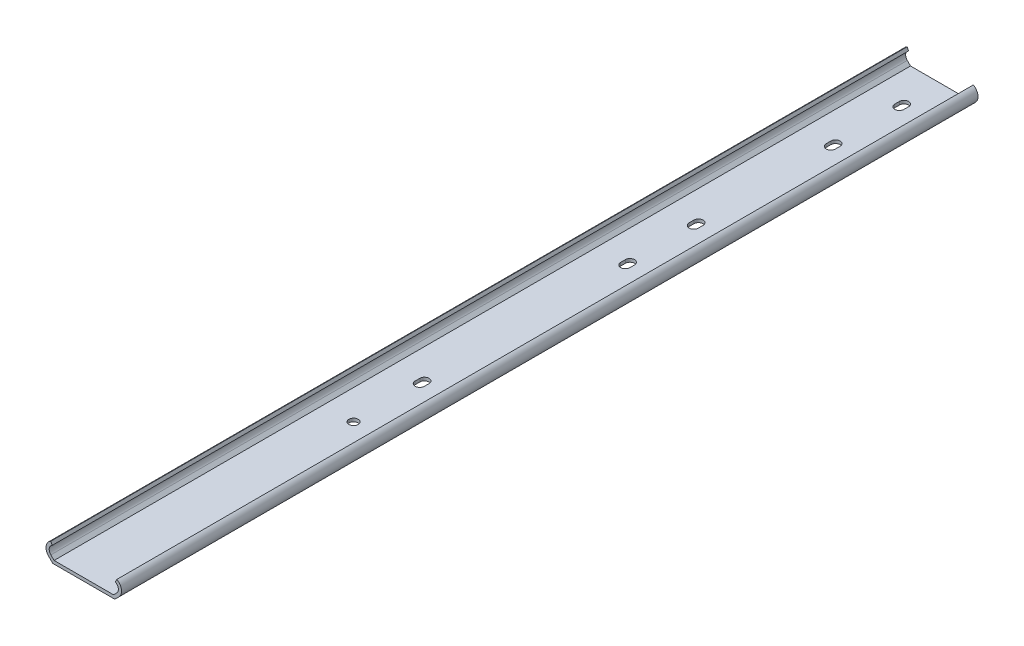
ISO-10303-21;
HEADER;
FILE_DESCRIPTION(('STEP AP214'),'2;1');
FILE_NAME('part.step','',(''),(''),'','','');
FILE_SCHEMA(('AUTOMOTIVE_DESIGN { 1 0 10303 214 1 1 1 1 }'));
ENDSEC;
DATA;
#1=APPLICATION_CONTEXT('core data for automotive mechanical design processes');
#2=APPLICATION_PROTOCOL_DEFINITION('international standard','automotive_design',2000,#1);
#3=PRODUCT_CONTEXT('',#1,'mechanical');
#4=PRODUCT('Part','Part','',(#3));
#5=PRODUCT_RELATED_PRODUCT_CATEGORY('part','',(#4));
#6=PRODUCT_DEFINITION_FORMATION('','',#4);
#7=PRODUCT_DEFINITION_CONTEXT('part definition',#1,'design');
#8=PRODUCT_DEFINITION('design','',#6,#7);
#9=PRODUCT_DEFINITION_SHAPE('','',#8);
#10=(LENGTH_UNIT() NAMED_UNIT(*) SI_UNIT(.MILLI.,.METRE.));
#11=(NAMED_UNIT(*) PLANE_ANGLE_UNIT() SI_UNIT($,.RADIAN.));
#12=(NAMED_UNIT(*) SI_UNIT($,.STERADIAN.) SOLID_ANGLE_UNIT());
#13=UNCERTAINTY_MEASURE_WITH_UNIT(LENGTH_MEASURE(1.E-05),#10,'distance_accuracy_value','');
#14=(GEOMETRIC_REPRESENTATION_CONTEXT(3) GLOBAL_UNCERTAINTY_ASSIGNED_CONTEXT((#13)) GLOBAL_UNIT_ASSIGNED_CONTEXT((#10,
#11,#12)) REPRESENTATION_CONTEXT('',''));
#15=CARTESIAN_POINT('',(0.,0.,0.));
#16=DIRECTION('',(0.,0.,1.));
#17=DIRECTION('',(1.,0.,0.));
#18=AXIS2_PLACEMENT_3D('',#15,#16,#17);
#19=CARTESIAN_POINT('',(14.2265419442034,-0.300999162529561,0.));
#20=DIRECTION('',(0.,0.,1.));
#21=DIRECTION('',(1.,0.,0.));
#22=AXIS2_PLACEMENT_3D('',#19,#20,#21);
#23=CYLINDRICAL_SURFACE('',#22,4.11568542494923);
#24=CARTESIAN_POINT('',(14.2265419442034,-0.300999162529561,0.));
#25=DIRECTION('',(0.,0.,1.));
#26=DIRECTION('',(1.,0.,0.));
#27=AXIS2_PLACEMENT_3D('',#24,#25,#26);
#28=CIRCLE('',#27,4.11568542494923);
#29=CARTESIAN_POINT('',(16.1373492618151,3.34422811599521,0.));
#30=VERTEX_POINT('',#29);
#31=CARTESIAN_POINT('',(17.1367710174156,-3.21122823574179,0.));
#32=VERTEX_POINT('',#31);
#33=EDGE_CURVE('E424',#30,#32,#28,.F.);
#34=ORIENTED_EDGE('',*,*,#33,.F.);
#35=DIRECTION('',(0.,0.,1.));
#36=VECTOR('',#35,1.);
#37=CARTESIAN_POINT('',(16.1373492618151,3.34422811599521,0.));
#38=LINE('',#37,#36);
#39=CARTESIAN_POINT('',(16.1373492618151,3.34422811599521,400.));
#40=VERTEX_POINT('',#39);
#41=EDGE_CURVE('E229',#40,#30,#38,.F.);
#42=ORIENTED_EDGE('',*,*,#41,.F.);
#43=CARTESIAN_POINT('',(14.2265419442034,-0.300999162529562,400.));
#44=DIRECTION('',(0.,0.,1.));
#45=DIRECTION('',(1.,0.,0.));
#46=AXIS2_PLACEMENT_3D('',#43,#44,#45);
#47=CIRCLE('',#46,4.11568542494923);
#48=CARTESIAN_POINT('',(17.1367710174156,-3.2112282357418,400.));
#49=VERTEX_POINT('',#48);
#50=EDGE_CURVE('E224',#49,#40,#47,.T.);
#51=ORIENTED_EDGE('',*,*,#50,.F.);
#52=DIRECTION('',(0.,0.,1.));
#53=VECTOR('',#52,1.);
#54=CARTESIAN_POINT('',(17.1367710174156,-3.2112282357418,0.));
#55=LINE('',#54,#53);
#56=EDGE_CURVE('E227',#32,#49,#55,.T.);
#57=ORIENTED_EDGE('',*,*,#56,.F.);
#58=EDGE_LOOP('',(#34,#42,#51,#57));
#59=FACE_BOUND('',#58,.T.);
#60=ADVANCED_FACE('F33',(#59),#23,.T.);
#61=CARTESIAN_POINT('',(15.4409376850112,2.01569098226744,0.));
#62=DIRECTION('',(-0.885691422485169,0.46427438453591,0.));
#63=DIRECTION('',(-0.46427438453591,-0.885691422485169,0.));
#64=AXIS2_PLACEMENT_3D('',#61,#62,#63);
#65=PLANE('',#64);
#66=DIRECTION('',(0.464274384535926,0.88569142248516,0.));
#67=VECTOR('',#66,1.);
#68=CARTESIAN_POINT('',(15.4409376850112,2.01569098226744,0.));
#69=LINE('',#68,#67);
#70=CARTESIAN_POINT('',(15.4409376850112,2.01569098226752,0.));
#71=VERTEX_POINT('',#70);
#72=EDGE_CURVE('E281',#71,#30,#69,.T.);
#73=ORIENTED_EDGE('',*,*,#72,.F.);
#74=DIRECTION('',(0.,0.,-1.));
#75=VECTOR('',#74,1.);
#76=CARTESIAN_POINT('',(15.4409376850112,2.01569098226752,150.));
#77=LINE('',#76,#75);
#78=CARTESIAN_POINT('',(15.4409376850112,2.01569098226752,400.));
#79=VERTEX_POINT('',#78);
#80=EDGE_CURVE('E279',#79,#71,#77,.T.);
#81=ORIENTED_EDGE('',*,*,#80,.F.);
#82=DIRECTION('',(-0.464274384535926,-0.88569142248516,0.));
#83=VECTOR('',#82,1.);
#84=CARTESIAN_POINT('',(16.1373492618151,3.3442281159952,400.));
#85=LINE('',#84,#83);
#86=EDGE_CURVE('E234',#40,#79,#85,.T.);
#87=ORIENTED_EDGE('',*,*,#86,.F.);
#88=ORIENTED_EDGE('',*,*,#41,.T.);
#89=EDGE_LOOP('',(#73,#81,#87,#88));
#90=FACE_BOUND('',#89,.T.);
#91=ADVANCED_FACE('F278',(#90),#65,.T.);
#92=CARTESIAN_POINT('',(14.2265419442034,-0.300999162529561,0.));
#93=DIRECTION('',(0.,0.,1.));
#94=DIRECTION('',(1.,0.,0.));
#95=AXIS2_PLACEMENT_3D('',#92,#93,#94);
#96=CYLINDRICAL_SURFACE('',#95,2.61568542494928);
#97=CARTESIAN_POINT('',(14.2265419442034,-0.300999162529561,0.));
#98=DIRECTION('',(0.,0.,1.));
#99=DIRECTION('',(1.,0.,0.));
#100=AXIS2_PLACEMENT_3D('',#97,#98,#99);
#101=CIRCLE('',#100,2.61568542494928);
#102=CARTESIAN_POINT('',(16.0761108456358,-2.15056806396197,0.));
#103=VERTEX_POINT('',#102);
#104=EDGE_CURVE('E290',#103,#71,#101,.T.);
#105=ORIENTED_EDGE('',*,*,#104,.F.);
#106=DIRECTION('',(0.,0.,1.));
#107=VECTOR('',#106,1.);
#108=CARTESIAN_POINT('',(16.0761108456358,-2.15056806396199,0.));
#109=LINE('',#108,#107);
#110=CARTESIAN_POINT('',(16.0761108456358,-2.15056806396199,400.));
#111=VERTEX_POINT('',#110);
#112=EDGE_CURVE('E288',#111,#103,#109,.F.);
#113=ORIENTED_EDGE('',*,*,#112,.F.);
#114=CARTESIAN_POINT('',(14.2265419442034,-0.300999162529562,400.));
#115=DIRECTION('',(0.,0.,1.));
#116=DIRECTION('',(1.,0.,0.));
#117=AXIS2_PLACEMENT_3D('',#114,#115,#116);
#118=CIRCLE('',#117,2.61568542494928);
#119=EDGE_CURVE('E272',#79,#111,#118,.F.);
#120=ORIENTED_EDGE('',*,*,#119,.F.);
#121=ORIENTED_EDGE('',*,*,#80,.T.);
#122=EDGE_LOOP('',(#105,#113,#120,#121));
#123=FACE_BOUND('',#122,.T.);
#124=ADVANCED_FACE('F287',(#123),#96,.F.);
#125=CARTESIAN_POINT('',(-12.8420872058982,-0.300999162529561,0.));
#126=DIRECTION('',(0.,0.,1.));
#127=DIRECTION('',(1.,0.,0.));
#128=AXIS2_PLACEMENT_3D('',#125,#126,#127);
#129=CYLINDRICAL_SURFACE('',#128,2.61568542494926);
#130=CARTESIAN_POINT('',(-12.8420872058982,-0.300999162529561,0.));
#131=DIRECTION('',(0.,0.,1.));
#132=DIRECTION('',(1.,0.,0.));
#133=AXIS2_PLACEMENT_3D('',#130,#131,#132);
#134=CIRCLE('',#133,2.61568542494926);
#135=CARTESIAN_POINT('',(-14.056482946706,2.01569098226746,0.));
#136=VERTEX_POINT('',#135);
#137=CARTESIAN_POINT('',(-14.6916561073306,-2.15056806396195,0.));
#138=VERTEX_POINT('',#137);
#139=EDGE_CURVE('E417',#136,#138,#134,.T.);
#140=ORIENTED_EDGE('',*,*,#139,.F.);
#141=DIRECTION('',(0.,0.,1.));
#142=VECTOR('',#141,1.);
#143=CARTESIAN_POINT('',(-14.056482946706,2.01569098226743,0.));
#144=LINE('',#143,#142);
#145=CARTESIAN_POINT('',(-14.056482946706,2.01569098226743,400.));
#146=VERTEX_POINT('',#145);
#147=EDGE_CURVE('E285',#146,#136,#144,.F.);
#148=ORIENTED_EDGE('',*,*,#147,.F.);
#149=CARTESIAN_POINT('',(-12.8420872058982,-0.300999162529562,400.));
#150=DIRECTION('',(0.,0.,1.));
#151=DIRECTION('',(1.,0.,0.));
#152=AXIS2_PLACEMENT_3D('',#149,#150,#151);
#153=CIRCLE('',#152,2.61568542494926);
#154=CARTESIAN_POINT('',(-14.6916561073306,-2.15056806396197,400.));
#155=VERTEX_POINT('',#154);
#156=EDGE_CURVE('E256',#155,#146,#153,.F.);
#157=ORIENTED_EDGE('',*,*,#156,.F.);
#158=DIRECTION('',(0.,0.,1.));
#159=VECTOR('',#158,1.);
#160=CARTESIAN_POINT('',(-14.6916561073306,-2.15056806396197,0.));
#161=LINE('',#160,#159);
#162=EDGE_CURVE('E295',#138,#155,#161,.T.);
#163=ORIENTED_EDGE('',*,*,#162,.F.);
#164=EDGE_LOOP('',(#140,#148,#157,#163));
#165=FACE_BOUND('',#164,.T.);
#166=ADVANCED_FACE('F860',(#165),#129,.F.);
#167=CARTESIAN_POINT('',(-14.7528945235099,3.3442281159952,0.));
#168=DIRECTION('',(0.885691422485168,0.464274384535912,0.));
#169=DIRECTION('',(-0.464274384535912,0.885691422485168,0.));
#170=AXIS2_PLACEMENT_3D('',#167,#168,#169);
#171=PLANE('',#170);
#172=DIRECTION('',(0.464274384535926,-0.88569142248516,0.));
#173=VECTOR('',#172,1.);
#174=CARTESIAN_POINT('',(-14.7528945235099,3.3442281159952,0.));
#175=LINE('',#174,#173);
#176=CARTESIAN_POINT('',(-14.7528945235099,3.3442281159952,0.));
#177=VERTEX_POINT('',#176);
#178=EDGE_CURVE('E420',#177,#136,#175,.T.);
#179=ORIENTED_EDGE('',*,*,#178,.F.);
#180=DIRECTION('',(0.,0.,1.));
#181=VECTOR('',#180,1.);
#182=CARTESIAN_POINT('',(-14.7528945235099,3.34422811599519,0.));
#183=LINE('',#182,#181);
#184=CARTESIAN_POINT('',(-14.7528945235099,3.34422811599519,400.));
#185=VERTEX_POINT('',#184);
#186=EDGE_CURVE('E430',#185,#177,#183,.F.);
#187=ORIENTED_EDGE('',*,*,#186,.F.);
#188=DIRECTION('',(-0.464274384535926,0.88569142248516,0.));
#189=VECTOR('',#188,1.);
#190=CARTESIAN_POINT('',(-14.056482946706,2.01569098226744,400.));
#191=LINE('',#190,#189);
#192=EDGE_CURVE('E251',#146,#185,#191,.T.);
#193=ORIENTED_EDGE('',*,*,#192,.F.);
#194=ORIENTED_EDGE('',*,*,#147,.T.);
#195=EDGE_LOOP('',(#179,#187,#193,#194));
#196=FACE_BOUND('',#195,.T.);
#197=ADVANCED_FACE('F852',(#196),#171,.T.);
#198=CARTESIAN_POINT('',(-12.8420872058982,-0.300999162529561,0.));
#199=DIRECTION('',(0.,0.,1.));
#200=DIRECTION('',(1.,0.,0.));
#201=AXIS2_PLACEMENT_3D('',#198,#199,#200);
#202=CYLINDRICAL_SURFACE('',#201,4.11568542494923);
#203=CARTESIAN_POINT('',(-12.8420872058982,-0.300999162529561,0.));
#204=DIRECTION('',(0.,0.,1.));
#205=DIRECTION('',(1.,0.,0.));
#206=AXIS2_PLACEMENT_3D('',#203,#204,#205);
#207=CIRCLE('',#206,4.11568542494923);
#208=CARTESIAN_POINT('',(-15.7523162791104,-3.21122823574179,0.));
#209=VERTEX_POINT('',#208);
#210=EDGE_CURVE('E421',#209,#177,#207,.F.);
#211=ORIENTED_EDGE('',*,*,#210,.F.);
#212=DIRECTION('',(0.,0.,1.));
#213=VECTOR('',#212,1.);
#214=CARTESIAN_POINT('',(-15.7523162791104,-3.2112282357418,0.));
#215=LINE('',#214,#213);
#216=CARTESIAN_POINT('',(-15.7523162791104,-3.2112282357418,400.));
#217=VERTEX_POINT('',#216);
#218=EDGE_CURVE('E249',#217,#209,#215,.F.);
#219=ORIENTED_EDGE('',*,*,#218,.F.);
#220=CARTESIAN_POINT('',(-12.8420872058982,-0.300999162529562,400.));
#221=DIRECTION('',(0.,0.,1.));
#222=DIRECTION('',(1.,0.,0.));
#223=AXIS2_PLACEMENT_3D('',#220,#221,#222);
#224=CIRCLE('',#223,4.11568542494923);
#225=EDGE_CURVE('E247',#185,#217,#224,.T.);
#226=ORIENTED_EDGE('',*,*,#225,.F.);
#227=ORIENTED_EDGE('',*,*,#186,.T.);
#228=EDGE_LOOP('',(#211,#219,#226,#227));
#229=FACE_BOUND('',#228,.T.);
#230=ADVANCED_FACE('F846',(#229),#202,.T.);
#231=CARTESIAN_POINT('',(-14.6916561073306,-2.15056806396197,0.));
#232=DIRECTION('',(0.707106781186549,0.707106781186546,0.));
#233=DIRECTION('',(-0.707106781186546,0.707106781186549,0.));
#234=AXIS2_PLACEMENT_3D('',#231,#232,#233);
#235=PLANE('',#234);
#236=DIRECTION('',(0.707106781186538,-0.707106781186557,0.));
#237=VECTOR('',#236,1.);
#238=CARTESIAN_POINT('',(-14.6916561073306,-2.15056806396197,0.));
#239=LINE('',#238,#237);
#240=CARTESIAN_POINT('',(-13.1864522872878,-3.65577188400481,0.));
#241=VERTEX_POINT('',#240);
#242=EDGE_CURVE('E324',#138,#241,#239,.T.);
#243=ORIENTED_EDGE('',*,*,#242,.F.);
#244=ORIENTED_EDGE('',*,*,#162,.T.);
#245=DIRECTION('',(-0.707106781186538,0.707106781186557,0.));
#246=VECTOR('',#245,1.);
#247=CARTESIAN_POINT('',(-13.1864522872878,-3.65577188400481,400.));
#248=LINE('',#247,#246);
#249=CARTESIAN_POINT('',(-13.1864522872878,-3.65577188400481,400.));
#250=VERTEX_POINT('',#249);
#251=EDGE_CURVE('E262',#250,#155,#248,.T.);
#252=ORIENTED_EDGE('',*,*,#251,.F.);
#253=DIRECTION('',(0.,0.,1.));
#254=VECTOR('',#253,1.);
#255=CARTESIAN_POINT('',(-13.1864522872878,-3.65577188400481,0.));
#256=LINE('',#255,#254);
#257=EDGE_CURVE('E270',#241,#250,#256,.T.);
#258=ORIENTED_EDGE('',*,*,#257,.F.);
#259=EDGE_LOOP('',(#243,#244,#252,#258));
#260=FACE_BOUND('',#259,.T.);
#261=ADVANCED_FACE('F839',(#260),#235,.T.);
#262=CARTESIAN_POINT('',(14.570907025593,-3.6557718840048,0.));
#263=DIRECTION('',(-0.707106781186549,0.707106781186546,0.));
#264=DIRECTION('',(-0.707106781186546,-0.707106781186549,0.));
#265=AXIS2_PLACEMENT_3D('',#262,#263,#264);
#266=PLANE('',#265);
#267=DIRECTION('',(0.707106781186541,0.707106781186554,0.));
#268=VECTOR('',#267,1.);
#269=CARTESIAN_POINT('',(14.570907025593,-3.6557718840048,0.));
#270=LINE('',#269,#268);
#271=CARTESIAN_POINT('',(14.570907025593,-3.65577188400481,0.));
#272=VERTEX_POINT('',#271);
#273=EDGE_CURVE('E294',#272,#103,#270,.T.);
#274=ORIENTED_EDGE('',*,*,#273,.F.);
#275=DIRECTION('',(0.,0.,1.));
#276=VECTOR('',#275,1.);
#277=CARTESIAN_POINT('',(14.570907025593,-3.65577188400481,0.));
#278=LINE('',#277,#276);
#279=CARTESIAN_POINT('',(14.570907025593,-3.65577188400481,400.));
#280=VERTEX_POINT('',#279);
#281=EDGE_CURVE('E269',#280,#272,#278,.F.);
#282=ORIENTED_EDGE('',*,*,#281,.F.);
#283=DIRECTION('',(-0.707106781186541,-0.707106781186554,0.));
#284=VECTOR('',#283,1.);
#285=CARTESIAN_POINT('',(16.0761108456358,-2.15056806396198,400.));
#286=LINE('',#285,#284);
#287=EDGE_CURVE('E265',#111,#280,#286,.T.);
#288=ORIENTED_EDGE('',*,*,#287,.F.);
#289=ORIENTED_EDGE('',*,*,#112,.T.);
#290=EDGE_LOOP('',(#274,#282,#288,#289));
#291=FACE_BOUND('',#290,.T.);
#292=ADVANCED_FACE('F298',(#291),#266,.T.);
#293=CARTESIAN_POINT('',(0.692227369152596,-2.89856209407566,0.));
#294=DIRECTION('',(0.,0.,-1.));
#295=DIRECTION('',(-1.,0.,0.));
#296=AXIS2_PLACEMENT_3D('',#293,#294,#295);
#297=PLANE('',#296);
#298=ORIENTED_EDGE('',*,*,#139,.T.);
#299=ORIENTED_EDGE('',*,*,#242,.T.);
#300=DIRECTION('',(1.,0.,0.));
#301=VECTOR('',#300,1.);
#302=CARTESIAN_POINT('',(-13.1864522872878,-3.65577188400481,0.));
#303=LINE('',#302,#301);
#304=EDGE_CURVE('E307',#272,#241,#303,.F.);
#305=ORIENTED_EDGE('',*,*,#304,.F.);
#306=ORIENTED_EDGE('',*,*,#273,.T.);
#307=ORIENTED_EDGE('',*,*,#104,.T.);
#308=ORIENTED_EDGE('',*,*,#72,.T.);
#309=ORIENTED_EDGE('',*,*,#33,.T.);
#310=DIRECTION('',(0.707106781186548,0.707106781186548,0.));
#311=VECTOR('',#310,1.);
#312=CARTESIAN_POINT('',(17.1367710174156,-3.2112282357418,0.));
#313=LINE('',#312,#311);
#314=CARTESIAN_POINT('',(15.1922273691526,-5.1557718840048,0.));
#315=VERTEX_POINT('',#314);
#316=EDGE_CURVE('E241',#315,#32,#313,.T.);
#317=ORIENTED_EDGE('',*,*,#316,.F.);
#318=DIRECTION('',(1.,0.,0.));
#319=VECTOR('',#318,1.);
#320=CARTESIAN_POINT('',(0.692227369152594,-5.1557718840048,0.));
#321=LINE('',#320,#319);
#322=CARTESIAN_POINT('',(-13.8077726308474,-5.1557718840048,0.));
#323=VERTEX_POINT('',#322);
#324=EDGE_CURVE('E377',#323,#315,#321,.T.);
#325=ORIENTED_EDGE('',*,*,#324,.F.);
#326=DIRECTION('',(0.707106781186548,-0.707106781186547,0.));
#327=VECTOR('',#326,1.);
#328=CARTESIAN_POINT('',(-13.8077726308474,-5.1557718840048,0.));
#329=LINE('',#328,#327);
#330=EDGE_CURVE('E429',#209,#323,#329,.T.);
#331=ORIENTED_EDGE('',*,*,#330,.F.);
#332=ORIENTED_EDGE('',*,*,#210,.T.);
#333=ORIENTED_EDGE('',*,*,#178,.T.);
#334=EDGE_LOOP('',(#298,#299,#305,#306,#307,#308,#309,#317,#325,#331,#332,#333));
#335=FACE_BOUND('',#334,.T.);
#336=ADVANCED_FACE('F823',(#335),#297,.T.);
#337=CARTESIAN_POINT('',(17.1367710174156,-3.2112282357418,0.));
#338=DIRECTION('',(0.707106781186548,-0.707106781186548,0.));
#339=DIRECTION('',(0.707106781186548,0.707106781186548,0.));
#340=AXIS2_PLACEMENT_3D('',#337,#338,#339);
#341=PLANE('',#340);
#342=ORIENTED_EDGE('',*,*,#316,.T.);
#343=ORIENTED_EDGE('',*,*,#56,.T.);
#344=DIRECTION('',(0.707106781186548,0.707106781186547,0.));
#345=VECTOR('',#344,1.);
#346=CARTESIAN_POINT('',(15.1922273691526,-5.1557718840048,400.));
#347=LINE('',#346,#345);
#348=CARTESIAN_POINT('',(15.1922273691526,-5.1557718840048,400.));
#349=VERTEX_POINT('',#348);
#350=EDGE_CURVE('E37',#349,#49,#347,.T.);
#351=ORIENTED_EDGE('',*,*,#350,.F.);
#352=DIRECTION('',(0.,0.,-1.));
#353=VECTOR('',#352,1.);
#354=CARTESIAN_POINT('',(15.1922273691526,-5.1557718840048,0.));
#355=LINE('',#354,#353);
#356=EDGE_CURVE('E434',#315,#349,#355,.F.);
#357=ORIENTED_EDGE('',*,*,#356,.F.);
#358=EDGE_LOOP('',(#342,#343,#351,#357));
#359=FACE_BOUND('',#358,.T.);
#360=ADVANCED_FACE('F237',(#359),#341,.T.);
#361=CARTESIAN_POINT('',(0.692227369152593,-2.89856209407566,400.));
#362=DIRECTION('',(0.,0.,1.));
#363=DIRECTION('',(1.,0.,0.));
#364=AXIS2_PLACEMENT_3D('',#361,#362,#363);
#365=PLANE('',#364);
#366=DIRECTION('',(1.,0.,0.));
#367=VECTOR('',#366,1.);
#368=CARTESIAN_POINT('',(0.692227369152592,-5.1557718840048,400.));
#369=LINE('',#368,#367);
#370=CARTESIAN_POINT('',(-13.8077726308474,-5.1557718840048,400.));
#371=VERTEX_POINT('',#370);
#372=EDGE_CURVE('E244',#349,#371,#369,.F.);
#373=ORIENTED_EDGE('',*,*,#372,.F.);
#374=ORIENTED_EDGE('',*,*,#350,.T.);
#375=ORIENTED_EDGE('',*,*,#50,.T.);
#376=ORIENTED_EDGE('',*,*,#86,.T.);
#377=ORIENTED_EDGE('',*,*,#119,.T.);
#378=ORIENTED_EDGE('',*,*,#287,.T.);
#379=DIRECTION('',(1.,0.,0.));
#380=VECTOR('',#379,1.);
#381=CARTESIAN_POINT('',(-13.1864522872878,-3.65577188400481,400.));
#382=LINE('',#381,#380);
#383=EDGE_CURVE('E266',#250,#280,#382,.T.);
#384=ORIENTED_EDGE('',*,*,#383,.F.);
#385=ORIENTED_EDGE('',*,*,#251,.T.);
#386=ORIENTED_EDGE('',*,*,#156,.T.);
#387=ORIENTED_EDGE('',*,*,#192,.T.);
#388=ORIENTED_EDGE('',*,*,#225,.T.);
#389=DIRECTION('',(0.707106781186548,-0.707106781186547,0.));
#390=VECTOR('',#389,1.);
#391=CARTESIAN_POINT('',(-13.8077726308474,-5.1557718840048,400.));
#392=LINE('',#391,#390);
#393=EDGE_CURVE('E246',#371,#217,#392,.F.);
#394=ORIENTED_EDGE('',*,*,#393,.F.);
#395=EDGE_LOOP('',(#373,#374,#375,#376,#377,#378,#384,#385,#386,#387,#388,#394));
#396=FACE_BOUND('',#395,.T.);
#397=ADVANCED_FACE('F35',(#396),#365,.T.);
#398=CARTESIAN_POINT('',(-13.8077726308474,-5.1557718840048,0.));
#399=DIRECTION('',(-0.707106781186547,-0.707106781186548,0.));
#400=DIRECTION('',(0.707106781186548,-0.707106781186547,0.));
#401=AXIS2_PLACEMENT_3D('',#398,#399,#400);
#402=PLANE('',#401);
#403=ORIENTED_EDGE('',*,*,#330,.T.);
#404=DIRECTION('',(0.,0.,-1.));
#405=VECTOR('',#404,1.);
#406=CARTESIAN_POINT('',(-13.8077726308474,-5.1557718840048,0.));
#407=LINE('',#406,#405);
#408=EDGE_CURVE('E374',#371,#323,#407,.T.);
#409=ORIENTED_EDGE('',*,*,#408,.F.);
#410=ORIENTED_EDGE('',*,*,#393,.T.);
#411=ORIENTED_EDGE('',*,*,#218,.T.);
#412=EDGE_LOOP('',(#403,#409,#410,#411));
#413=FACE_BOUND('',#412,.T.);
#414=ADVANCED_FACE('F803',(#413),#402,.T.);
#415=CARTESIAN_POINT('',(0.692227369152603,-3.65577188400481,16.9));
#416=DIRECTION('',(0.,-1.,0.));
#417=DIRECTION('',(0.,0.,-1.));
#418=AXIS2_PLACEMENT_3D('',#415,#416,#417);
#419=CYLINDRICAL_SURFACE('',#418,2.15000000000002);
#420=CARTESIAN_POINT('',(0.692227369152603,-3.65577188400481,16.9));
#421=DIRECTION('',(0.,-1.,0.));
#422=DIRECTION('',(0.,0.,-1.));
#423=AXIS2_PLACEMENT_3D('',#420,#421,#422);
#424=CIRCLE('',#423,2.15000000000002);
#425=CARTESIAN_POINT('',(-1.4577726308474,-3.65577188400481,16.9));
#426=VERTEX_POINT('',#425);
#427=CARTESIAN_POINT('',(2.84222736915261,-3.65577188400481,16.9));
#428=VERTEX_POINT('',#427);
#429=EDGE_CURVE('E383',#426,#428,#424,.T.);
#430=ORIENTED_EDGE('',*,*,#429,.F.);
#431=DIRECTION('',(0.,1.,0.));
#432=VECTOR('',#431,1.);
#433=CARTESIAN_POINT('',(-1.4577726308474,-3.6557718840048,16.9));
#434=LINE('',#433,#432);
#435=CARTESIAN_POINT('',(-1.4577726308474,-5.1557718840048,16.9));
#436=VERTEX_POINT('',#435);
#437=EDGE_CURVE('E449',#436,#426,#434,.T.);
#438=ORIENTED_EDGE('',*,*,#437,.F.);
#439=CARTESIAN_POINT('',(0.692227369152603,-5.1557718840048,16.9));
#440=DIRECTION('',(0.,-1.,0.));
#441=DIRECTION('',(0.,0.,-1.));
#442=AXIS2_PLACEMENT_3D('',#439,#440,#441);
#443=CIRCLE('',#442,2.15000000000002);
#444=CARTESIAN_POINT('',(2.84222736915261,-5.1557718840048,16.9));
#445=VERTEX_POINT('',#444);
#446=EDGE_CURVE('E371',#445,#436,#443,.F.);
#447=ORIENTED_EDGE('',*,*,#446,.F.);
#448=DIRECTION('',(0.,1.,0.));
#449=VECTOR('',#448,1.);
#450=CARTESIAN_POINT('',(2.84222736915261,-3.6557718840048,16.9));
#451=LINE('',#450,#449);
#452=EDGE_CURVE('E465',#428,#445,#451,.F.);
#453=ORIENTED_EDGE('',*,*,#452,.F.);
#454=EDGE_LOOP('',(#430,#438,#447,#453));
#455=FACE_BOUND('',#454,.T.);
#456=ADVANCED_FACE('F794',(#455),#419,.F.);
#457=CARTESIAN_POINT('',(-1.4577726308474,-3.6557718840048,18.));
#458=DIRECTION('',(1.,0.,0.));
#459=DIRECTION('',(0.,0.,-1.));
#460=AXIS2_PLACEMENT_3D('',#457,#458,#459);
#461=PLANE('',#460);
#462=DIRECTION('',(0.,0.,1.));
#463=VECTOR('',#462,1.);
#464=CARTESIAN_POINT('',(-1.4577726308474,-3.65577188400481,0.));
#465=LINE('',#464,#463);
#466=CARTESIAN_POINT('',(-1.45777263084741,-3.65577188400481,19.1));
#467=VERTEX_POINT('',#466);
#468=EDGE_CURVE('E378',#467,#426,#465,.F.);
#469=ORIENTED_EDGE('',*,*,#468,.F.);
#470=DIRECTION('',(0.,1.,0.));
#471=VECTOR('',#470,1.);
#472=CARTESIAN_POINT('',(-1.45777263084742,-4.4057718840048,19.1));
#473=LINE('',#472,#471);
#474=CARTESIAN_POINT('',(-1.45777263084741,-5.1557718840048,19.1));
#475=VERTEX_POINT('',#474);
#476=EDGE_CURVE('E462',#475,#467,#473,.T.);
#477=ORIENTED_EDGE('',*,*,#476,.F.);
#478=DIRECTION('',(0.,0.,-1.));
#479=VECTOR('',#478,1.);
#480=CARTESIAN_POINT('',(-1.4577726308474,-5.1557718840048,0.));
#481=LINE('',#480,#479);
#482=EDGE_CURVE('E370',#436,#475,#481,.F.);
#483=ORIENTED_EDGE('',*,*,#482,.F.);
#484=ORIENTED_EDGE('',*,*,#437,.T.);
#485=EDGE_LOOP('',(#469,#477,#483,#484));
#486=FACE_BOUND('',#485,.T.);
#487=ADVANCED_FACE('F785',(#486),#461,.T.);
#488=CARTESIAN_POINT('',(0.692227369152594,-3.65577188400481,19.1));
#489=DIRECTION('',(0.,-1.,0.));
#490=DIRECTION('',(0.,0.,-1.));
#491=AXIS2_PLACEMENT_3D('',#488,#489,#490);
#492=CYLINDRICAL_SURFACE('',#491,2.15000000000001);
#493=CARTESIAN_POINT('',(0.692227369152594,-3.65577188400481,19.1));
#494=DIRECTION('',(0.,-1.,0.));
#495=DIRECTION('',(0.,0.,-1.));
#496=AXIS2_PLACEMENT_3D('',#493,#494,#495);
#497=CIRCLE('',#496,2.15000000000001);
#498=CARTESIAN_POINT('',(2.84222736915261,-3.65577188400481,19.1));
#499=VERTEX_POINT('',#498);
#500=EDGE_CURVE('E379',#499,#467,#497,.T.);
#501=ORIENTED_EDGE('',*,*,#500,.F.);
#502=DIRECTION('',(0.,1.,0.));
#503=VECTOR('',#502,1.);
#504=CARTESIAN_POINT('',(2.84222736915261,-3.6557718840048,19.1));
#505=LINE('',#504,#503);
#506=CARTESIAN_POINT('',(2.84222736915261,-5.1557718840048,19.1));
#507=VERTEX_POINT('',#506);
#508=EDGE_CURVE('E464',#507,#499,#505,.T.);
#509=ORIENTED_EDGE('',*,*,#508,.F.);
#510=CARTESIAN_POINT('',(0.692227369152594,-5.1557718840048,19.1));
#511=DIRECTION('',(0.,-1.,0.));
#512=DIRECTION('',(0.,0.,-1.));
#513=AXIS2_PLACEMENT_3D('',#510,#511,#512);
#514=CIRCLE('',#513,2.15000000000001);
#515=EDGE_CURVE('E367',#475,#507,#514,.F.);
#516=ORIENTED_EDGE('',*,*,#515,.F.);
#517=ORIENTED_EDGE('',*,*,#476,.T.);
#518=EDGE_LOOP('',(#501,#509,#516,#517));
#519=FACE_BOUND('',#518,.T.);
#520=ADVANCED_FACE('F776',(#519),#492,.F.);
#521=CARTESIAN_POINT('',(2.84222736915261,-3.6557718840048,19.1));
#522=DIRECTION('',(-1.,0.,0.));
#523=DIRECTION('',(0.,0.,1.));
#524=AXIS2_PLACEMENT_3D('',#521,#522,#523);
#525=PLANE('',#524);
#526=DIRECTION('',(0.,0.,1.));
#527=VECTOR('',#526,1.);
#528=CARTESIAN_POINT('',(2.84222736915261,-3.65577188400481,0.));
#529=LINE('',#528,#527);
#530=EDGE_CURVE('E382',#428,#499,#529,.T.);
#531=ORIENTED_EDGE('',*,*,#530,.F.);
#532=ORIENTED_EDGE('',*,*,#452,.T.);
#533=DIRECTION('',(0.,0.,-1.));
#534=VECTOR('',#533,1.);
#535=CARTESIAN_POINT('',(2.84222736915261,-5.1557718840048,0.));
#536=LINE('',#535,#534);
#537=EDGE_CURVE('E366',#507,#445,#536,.T.);
#538=ORIENTED_EDGE('',*,*,#537,.F.);
#539=ORIENTED_EDGE('',*,*,#508,.T.);
#540=EDGE_LOOP('',(#531,#532,#538,#539));
#541=FACE_BOUND('',#540,.T.);
#542=ADVANCED_FACE('F767',(#541),#525,.T.);
#543=CARTESIAN_POINT('',(0.692227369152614,-3.65577188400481,112.9));
#544=DIRECTION('',(0.,-1.,0.));
#545=DIRECTION('',(0.,0.,-1.));
#546=AXIS2_PLACEMENT_3D('',#543,#544,#545);
#547=CYLINDRICAL_SURFACE('',#546,2.15);
#548=CARTESIAN_POINT('',(0.692227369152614,-3.65577188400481,112.9));
#549=DIRECTION('',(0.,-1.,0.));
#550=DIRECTION('',(0.,0.,-1.));
#551=AXIS2_PLACEMENT_3D('',#548,#549,#550);
#552=CIRCLE('',#551,2.15);
#553=CARTESIAN_POINT('',(-1.45777263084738,-3.65577188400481,112.9));
#554=VERTEX_POINT('',#553);
#555=CARTESIAN_POINT('',(2.84222736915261,-3.65577188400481,112.9));
#556=VERTEX_POINT('',#555);
#557=EDGE_CURVE('E391',#554,#556,#552,.T.);
#558=ORIENTED_EDGE('',*,*,#557,.F.);
#559=DIRECTION('',(0.,1.,0.));
#560=VECTOR('',#559,1.);
#561=CARTESIAN_POINT('',(-1.45777263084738,-3.6557718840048,112.9));
#562=LINE('',#561,#560);
#563=CARTESIAN_POINT('',(-1.45777263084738,-5.1557718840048,112.9));
#564=VERTEX_POINT('',#563);
#565=EDGE_CURVE('E468',#564,#554,#562,.T.);
#566=ORIENTED_EDGE('',*,*,#565,.F.);
#567=CARTESIAN_POINT('',(0.692227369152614,-5.1557718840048,112.9));
#568=DIRECTION('',(0.,-1.,0.));
#569=DIRECTION('',(0.,0.,-1.));
#570=AXIS2_PLACEMENT_3D('',#567,#568,#569);
#571=CIRCLE('',#570,2.15);
#572=CARTESIAN_POINT('',(2.84222736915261,-5.1557718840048,112.9));
#573=VERTEX_POINT('',#572);
#574=EDGE_CURVE('E363',#573,#564,#571,.F.);
#575=ORIENTED_EDGE('',*,*,#574,.F.);
#576=DIRECTION('',(0.,1.,0.));
#577=VECTOR('',#576,1.);
#578=CARTESIAN_POINT('',(2.84222736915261,-3.6557718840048,112.9));
#579=LINE('',#578,#577);
#580=EDGE_CURVE('E475',#556,#573,#579,.F.);
#581=ORIENTED_EDGE('',*,*,#580,.F.);
#582=EDGE_LOOP('',(#558,#566,#575,#581));
#583=FACE_BOUND('',#582,.T.);
#584=ADVANCED_FACE('F758',(#583),#547,.F.);
#585=CARTESIAN_POINT('',(-1.45777263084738,-3.6557718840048,114.));
#586=DIRECTION('',(1.,0.,0.));
#587=DIRECTION('',(0.,0.,-1.));
#588=AXIS2_PLACEMENT_3D('',#585,#586,#587);
#589=PLANE('',#588);
#590=DIRECTION('',(0.,0.,1.));
#591=VECTOR('',#590,1.);
#592=CARTESIAN_POINT('',(-1.45777263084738,-3.65577188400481,0.));
#593=LINE('',#592,#591);
#594=CARTESIAN_POINT('',(-1.45777263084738,-3.65577188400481,115.1));
#595=VERTEX_POINT('',#594);
#596=EDGE_CURVE('E386',#595,#554,#593,.F.);
#597=ORIENTED_EDGE('',*,*,#596,.F.);
#598=DIRECTION('',(0.,1.,0.));
#599=VECTOR('',#598,1.);
#600=CARTESIAN_POINT('',(-1.45777263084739,-4.4057718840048,115.1));
#601=LINE('',#600,#599);
#602=CARTESIAN_POINT('',(-1.45777263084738,-5.1557718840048,115.1));
#603=VERTEX_POINT('',#602);
#604=EDGE_CURVE('E472',#603,#595,#601,.T.);
#605=ORIENTED_EDGE('',*,*,#604,.F.);
#606=DIRECTION('',(0.,0.,-1.));
#607=VECTOR('',#606,1.);
#608=CARTESIAN_POINT('',(-1.45777263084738,-5.1557718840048,0.));
#609=LINE('',#608,#607);
#610=EDGE_CURVE('E362',#564,#603,#609,.F.);
#611=ORIENTED_EDGE('',*,*,#610,.F.);
#612=ORIENTED_EDGE('',*,*,#565,.T.);
#613=EDGE_LOOP('',(#597,#605,#611,#612));
#614=FACE_BOUND('',#613,.T.);
#615=ADVANCED_FACE('F749',(#614),#589,.T.);
#616=CARTESIAN_POINT('',(0.692227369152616,-3.65577188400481,115.1));
#617=DIRECTION('',(0.,-1.,0.));
#618=DIRECTION('',(0.,0.,-1.));
#619=AXIS2_PLACEMENT_3D('',#616,#617,#618);
#620=CYLINDRICAL_SURFACE('',#619,2.15);
#621=CARTESIAN_POINT('',(0.692227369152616,-3.65577188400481,115.1));
#622=DIRECTION('',(0.,-1.,0.));
#623=DIRECTION('',(0.,0.,-1.));
#624=AXIS2_PLACEMENT_3D('',#621,#622,#623);
#625=CIRCLE('',#624,2.15);
#626=CARTESIAN_POINT('',(2.84222736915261,-3.65577188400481,115.1));
#627=VERTEX_POINT('',#626);
#628=EDGE_CURVE('E387',#627,#595,#625,.T.);
#629=ORIENTED_EDGE('',*,*,#628,.F.);
#630=DIRECTION('',(0.,1.,0.));
#631=VECTOR('',#630,1.);
#632=CARTESIAN_POINT('',(2.84222736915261,-3.6557718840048,115.1));
#633=LINE('',#632,#631);
#634=CARTESIAN_POINT('',(2.84222736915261,-5.1557718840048,115.1));
#635=VERTEX_POINT('',#634);
#636=EDGE_CURVE('E474',#635,#627,#633,.T.);
#637=ORIENTED_EDGE('',*,*,#636,.F.);
#638=CARTESIAN_POINT('',(0.692227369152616,-5.1557718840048,115.1));
#639=DIRECTION('',(0.,-1.,0.));
#640=DIRECTION('',(0.,0.,-1.));
#641=AXIS2_PLACEMENT_3D('',#638,#639,#640);
#642=CIRCLE('',#641,2.15);
#643=EDGE_CURVE('E359',#603,#635,#642,.F.);
#644=ORIENTED_EDGE('',*,*,#643,.F.);
#645=ORIENTED_EDGE('',*,*,#604,.T.);
#646=EDGE_LOOP('',(#629,#637,#644,#645));
#647=FACE_BOUND('',#646,.T.);
#648=ADVANCED_FACE('F740',(#647),#620,.F.);
#649=CARTESIAN_POINT('',(2.84222736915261,-3.6557718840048,115.1));
#650=DIRECTION('',(-1.,0.,0.));
#651=DIRECTION('',(0.,0.,1.));
#652=AXIS2_PLACEMENT_3D('',#649,#650,#651);
#653=PLANE('',#652);
#654=DIRECTION('',(0.,0.,1.));
#655=VECTOR('',#654,1.);
#656=CARTESIAN_POINT('',(2.84222736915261,-3.65577188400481,0.));
#657=LINE('',#656,#655);
#658=EDGE_CURVE('E390',#556,#627,#657,.T.);
#659=ORIENTED_EDGE('',*,*,#658,.F.);
#660=ORIENTED_EDGE('',*,*,#580,.T.);
#661=DIRECTION('',(0.,0.,-1.));
#662=VECTOR('',#661,1.);
#663=CARTESIAN_POINT('',(2.84222736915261,-5.1557718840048,0.));
#664=LINE('',#663,#662);
#665=EDGE_CURVE('E358',#635,#573,#664,.T.);
#666=ORIENTED_EDGE('',*,*,#665,.F.);
#667=ORIENTED_EDGE('',*,*,#636,.T.);
#668=EDGE_LOOP('',(#659,#660,#666,#667));
#669=FACE_BOUND('',#668,.T.);
#670=ADVANCED_FACE('F731',(#669),#653,.T.);
#671=CARTESIAN_POINT('',(0.6922273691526,-3.65577188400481,240.9));
#672=DIRECTION('',(0.,-1.,0.));
#673=DIRECTION('',(0.,0.,-1.));
#674=AXIS2_PLACEMENT_3D('',#671,#672,#673);
#675=CYLINDRICAL_SURFACE('',#674,2.15);
#676=CARTESIAN_POINT('',(0.6922273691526,-3.65577188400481,240.9));
#677=DIRECTION('',(0.,-1.,0.));
#678=DIRECTION('',(0.,0.,-1.));
#679=AXIS2_PLACEMENT_3D('',#676,#677,#678);
#680=CIRCLE('',#679,2.15);
#681=CARTESIAN_POINT('',(-1.45777263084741,-3.65577188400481,240.9));
#682=VERTEX_POINT('',#681);
#683=CARTESIAN_POINT('',(2.8422273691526,-3.65577188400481,240.9));
#684=VERTEX_POINT('',#683);
#685=EDGE_CURVE('E399',#682,#684,#680,.T.);
#686=ORIENTED_EDGE('',*,*,#685,.F.);
#687=DIRECTION('',(0.,1.,0.));
#688=VECTOR('',#687,1.);
#689=CARTESIAN_POINT('',(-1.45777263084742,-3.6557718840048,240.9));
#690=LINE('',#689,#688);
#691=CARTESIAN_POINT('',(-1.45777263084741,-5.1557718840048,240.9));
#692=VERTEX_POINT('',#691);
#693=EDGE_CURVE('E478',#692,#682,#690,.T.);
#694=ORIENTED_EDGE('',*,*,#693,.F.);
#695=CARTESIAN_POINT('',(0.6922273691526,-5.1557718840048,240.9));
#696=DIRECTION('',(0.,-1.,0.));
#697=DIRECTION('',(0.,0.,-1.));
#698=AXIS2_PLACEMENT_3D('',#695,#696,#697);
#699=CIRCLE('',#698,2.15);
#700=CARTESIAN_POINT('',(2.8422273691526,-5.1557718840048,240.9));
#701=VERTEX_POINT('',#700);
#702=EDGE_CURVE('E355',#701,#692,#699,.F.);
#703=ORIENTED_EDGE('',*,*,#702,.F.);
#704=DIRECTION('',(0.,1.,0.));
#705=VECTOR('',#704,1.);
#706=CARTESIAN_POINT('',(2.8422273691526,-3.6557718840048,240.9));
#707=LINE('',#706,#705);
#708=EDGE_CURVE('E485',#684,#701,#707,.F.);
#709=ORIENTED_EDGE('',*,*,#708,.F.);
#710=EDGE_LOOP('',(#686,#694,#703,#709));
#711=FACE_BOUND('',#710,.T.);
#712=ADVANCED_FACE('F722',(#711),#675,.F.);
#713=CARTESIAN_POINT('',(-1.45777263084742,-3.6557718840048,242.));
#714=DIRECTION('',(1.,0.,0.));
#715=DIRECTION('',(0.,0.,-1.));
#716=AXIS2_PLACEMENT_3D('',#713,#714,#715);
#717=PLANE('',#716);
#718=DIRECTION('',(0.,0.,1.));
#719=VECTOR('',#718,1.);
#720=CARTESIAN_POINT('',(-1.4577726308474,-3.65577188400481,0.));
#721=LINE('',#720,#719);
#722=CARTESIAN_POINT('',(-1.4577726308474,-3.65577188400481,243.1));
#723=VERTEX_POINT('',#722);
#724=EDGE_CURVE('E394',#723,#682,#721,.F.);
#725=ORIENTED_EDGE('',*,*,#724,.F.);
#726=DIRECTION('',(0.,1.,0.));
#727=VECTOR('',#726,1.);
#728=CARTESIAN_POINT('',(-1.4577726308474,-4.4057718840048,243.1));
#729=LINE('',#728,#727);
#730=CARTESIAN_POINT('',(-1.4577726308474,-5.1557718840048,243.1));
#731=VERTEX_POINT('',#730);
#732=EDGE_CURVE('E482',#731,#723,#729,.T.);
#733=ORIENTED_EDGE('',*,*,#732,.F.);
#734=DIRECTION('',(0.,0.,-1.));
#735=VECTOR('',#734,1.);
#736=CARTESIAN_POINT('',(-1.4577726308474,-5.1557718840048,0.));
#737=LINE('',#736,#735);
#738=EDGE_CURVE('E354',#692,#731,#737,.F.);
#739=ORIENTED_EDGE('',*,*,#738,.F.);
#740=ORIENTED_EDGE('',*,*,#693,.T.);
#741=EDGE_LOOP('',(#725,#733,#739,#740));
#742=FACE_BOUND('',#741,.T.);
#743=ADVANCED_FACE('F713',(#742),#717,.T.);
#744=CARTESIAN_POINT('',(0.692227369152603,-3.65577188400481,243.1));
#745=DIRECTION('',(0.,-1.,0.));
#746=DIRECTION('',(0.,0.,-1.));
#747=AXIS2_PLACEMENT_3D('',#744,#745,#746);
#748=CYLINDRICAL_SURFACE('',#747,2.15);
#749=CARTESIAN_POINT('',(0.692227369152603,-3.65577188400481,243.1));
#750=DIRECTION('',(0.,-1.,0.));
#751=DIRECTION('',(0.,0.,-1.));
#752=AXIS2_PLACEMENT_3D('',#749,#750,#751);
#753=CIRCLE('',#752,2.15);
#754=CARTESIAN_POINT('',(2.8422273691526,-3.65577188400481,243.1));
#755=VERTEX_POINT('',#754);
#756=EDGE_CURVE('E395',#755,#723,#753,.T.);
#757=ORIENTED_EDGE('',*,*,#756,.F.);
#758=DIRECTION('',(0.,1.,0.));
#759=VECTOR('',#758,1.);
#760=CARTESIAN_POINT('',(2.8422273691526,-3.6557718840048,243.1));
#761=LINE('',#760,#759);
#762=CARTESIAN_POINT('',(2.8422273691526,-5.1557718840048,243.1));
#763=VERTEX_POINT('',#762);
#764=EDGE_CURVE('E484',#763,#755,#761,.T.);
#765=ORIENTED_EDGE('',*,*,#764,.F.);
#766=CARTESIAN_POINT('',(0.692227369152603,-5.1557718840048,243.1));
#767=DIRECTION('',(0.,-1.,0.));
#768=DIRECTION('',(0.,0.,-1.));
#769=AXIS2_PLACEMENT_3D('',#766,#767,#768);
#770=CIRCLE('',#769,2.15);
#771=EDGE_CURVE('E351',#731,#763,#770,.F.);
#772=ORIENTED_EDGE('',*,*,#771,.F.);
#773=ORIENTED_EDGE('',*,*,#732,.T.);
#774=EDGE_LOOP('',(#757,#765,#772,#773));
#775=FACE_BOUND('',#774,.T.);
#776=ADVANCED_FACE('F704',(#775),#748,.F.);
#777=CARTESIAN_POINT('',(2.8422273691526,-3.6557718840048,243.1));
#778=DIRECTION('',(-1.,0.,0.));
#779=DIRECTION('',(0.,0.,1.));
#780=AXIS2_PLACEMENT_3D('',#777,#778,#779);
#781=PLANE('',#780);
#782=DIRECTION('',(0.,0.,1.));
#783=VECTOR('',#782,1.);
#784=CARTESIAN_POINT('',(2.8422273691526,-3.65577188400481,0.));
#785=LINE('',#784,#783);
#786=EDGE_CURVE('E398',#684,#755,#785,.T.);
#787=ORIENTED_EDGE('',*,*,#786,.F.);
#788=ORIENTED_EDGE('',*,*,#708,.T.);
#789=DIRECTION('',(0.,0.,-1.));
#790=VECTOR('',#789,1.);
#791=CARTESIAN_POINT('',(2.8422273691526,-5.1557718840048,0.));
#792=LINE('',#791,#790);
#793=EDGE_CURVE('E350',#763,#701,#792,.T.);
#794=ORIENTED_EDGE('',*,*,#793,.F.);
#795=ORIENTED_EDGE('',*,*,#764,.T.);
#796=EDGE_LOOP('',(#787,#788,#794,#795));
#797=FACE_BOUND('',#796,.T.);
#798=ADVANCED_FACE('F696',(#797),#781,.T.);
#799=CARTESIAN_POINT('',(0.692227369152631,-3.65577188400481,144.9));
#800=DIRECTION('',(0.,-1.,0.));
#801=DIRECTION('',(0.,0.,-1.));
#802=AXIS2_PLACEMENT_3D('',#799,#800,#801);
#803=CYLINDRICAL_SURFACE('',#802,2.15);
#804=CARTESIAN_POINT('',(0.692227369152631,-3.65577188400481,144.9));
#805=DIRECTION('',(0.,-1.,0.));
#806=DIRECTION('',(0.,0.,-1.));
#807=AXIS2_PLACEMENT_3D('',#804,#805,#806);
#808=CIRCLE('',#807,2.15);
#809=CARTESIAN_POINT('',(-1.45777263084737,-3.65577188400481,144.9));
#810=VERTEX_POINT('',#809);
#811=CARTESIAN_POINT('',(2.84222736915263,-3.65577188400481,144.9));
#812=VERTEX_POINT('',#811);
#813=EDGE_CURVE('E407',#810,#812,#808,.T.);
#814=ORIENTED_EDGE('',*,*,#813,.F.);
#815=DIRECTION('',(0.,1.,0.));
#816=VECTOR('',#815,1.);
#817=CARTESIAN_POINT('',(-1.45777263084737,-3.6557718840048,144.9));
#818=LINE('',#817,#816);
#819=CARTESIAN_POINT('',(-1.45777263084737,-5.1557718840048,144.9));
#820=VERTEX_POINT('',#819);
#821=EDGE_CURVE('E488',#820,#810,#818,.T.);
#822=ORIENTED_EDGE('',*,*,#821,.F.);
#823=CARTESIAN_POINT('',(0.692227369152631,-5.1557718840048,144.9));
#824=DIRECTION('',(0.,-1.,0.));
#825=DIRECTION('',(0.,0.,-1.));
#826=AXIS2_PLACEMENT_3D('',#823,#824,#825);
#827=CIRCLE('',#826,2.15);
#828=CARTESIAN_POINT('',(2.84222736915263,-5.1557718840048,144.9));
#829=VERTEX_POINT('',#828);
#830=EDGE_CURVE('E346',#829,#820,#827,.F.);
#831=ORIENTED_EDGE('',*,*,#830,.F.);
#832=DIRECTION('',(0.,1.,0.));
#833=VECTOR('',#832,1.);
#834=CARTESIAN_POINT('',(2.84222736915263,-3.6557718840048,144.9));
#835=LINE('',#834,#833);
#836=EDGE_CURVE('E495',#812,#829,#835,.F.);
#837=ORIENTED_EDGE('',*,*,#836,.F.);
#838=EDGE_LOOP('',(#814,#822,#831,#837));
#839=FACE_BOUND('',#838,.T.);
#840=ADVANCED_FACE('F583',(#839),#803,.F.);
#841=CARTESIAN_POINT('',(-1.45777263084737,-3.6557718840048,146.));
#842=DIRECTION('',(1.,0.,0.));
#843=DIRECTION('',(0.,0.,-1.));
#844=AXIS2_PLACEMENT_3D('',#841,#842,#843);
#845=PLANE('',#844);
#846=DIRECTION('',(0.,0.,1.));
#847=VECTOR('',#846,1.);
#848=CARTESIAN_POINT('',(-1.45777263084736,-3.65577188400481,0.));
#849=LINE('',#848,#847);
#850=CARTESIAN_POINT('',(-1.45777263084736,-3.65577188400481,147.1));
#851=VERTEX_POINT('',#850);
#852=EDGE_CURVE('E402',#851,#810,#849,.F.);
#853=ORIENTED_EDGE('',*,*,#852,.F.);
#854=DIRECTION('',(0.,1.,0.));
#855=VECTOR('',#854,1.);
#856=CARTESIAN_POINT('',(-1.45777263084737,-4.4057718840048,147.1));
#857=LINE('',#856,#855);
#858=CARTESIAN_POINT('',(-1.45777263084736,-5.1557718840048,147.1));
#859=VERTEX_POINT('',#858);
#860=EDGE_CURVE('E492',#859,#851,#857,.T.);
#861=ORIENTED_EDGE('',*,*,#860,.F.);
#862=DIRECTION('',(0.,0.,-1.));
#863=VECTOR('',#862,1.);
#864=CARTESIAN_POINT('',(-1.45777263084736,-5.1557718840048,0.));
#865=LINE('',#864,#863);
#866=EDGE_CURVE('E345',#820,#859,#865,.F.);
#867=ORIENTED_EDGE('',*,*,#866,.F.);
#868=ORIENTED_EDGE('',*,*,#821,.T.);
#869=EDGE_LOOP('',(#853,#861,#867,#868));
#870=FACE_BOUND('',#869,.T.);
#871=ADVANCED_FACE('F586',(#870),#845,.T.);
#872=CARTESIAN_POINT('',(0.692227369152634,-3.65577188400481,147.1));
#873=DIRECTION('',(0.,-1.,0.));
#874=DIRECTION('',(0.,0.,-1.));
#875=AXIS2_PLACEMENT_3D('',#872,#873,#874);
#876=CYLINDRICAL_SURFACE('',#875,2.15);
#877=CARTESIAN_POINT('',(0.692227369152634,-3.65577188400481,147.1));
#878=DIRECTION('',(0.,-1.,0.));
#879=DIRECTION('',(0.,0.,-1.));
#880=AXIS2_PLACEMENT_3D('',#877,#878,#879);
#881=CIRCLE('',#880,2.15);
#882=CARTESIAN_POINT('',(2.84222736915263,-3.65577188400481,147.1));
#883=VERTEX_POINT('',#882);
#884=EDGE_CURVE('E403',#883,#851,#881,.T.);
#885=ORIENTED_EDGE('',*,*,#884,.F.);
#886=DIRECTION('',(0.,1.,0.));
#887=VECTOR('',#886,1.);
#888=CARTESIAN_POINT('',(2.84222736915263,-3.6557718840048,147.1));
#889=LINE('',#888,#887);
#890=CARTESIAN_POINT('',(2.84222736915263,-5.1557718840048,147.1));
#891=VERTEX_POINT('',#890);
#892=EDGE_CURVE('E494',#891,#883,#889,.T.);
#893=ORIENTED_EDGE('',*,*,#892,.F.);
#894=CARTESIAN_POINT('',(0.692227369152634,-5.1557718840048,147.1));
#895=DIRECTION('',(0.,-1.,0.));
#896=DIRECTION('',(0.,0.,-1.));
#897=AXIS2_PLACEMENT_3D('',#894,#895,#896);
#898=CIRCLE('',#897,2.15);
#899=EDGE_CURVE('E342',#859,#891,#898,.F.);
#900=ORIENTED_EDGE('',*,*,#899,.F.);
#901=ORIENTED_EDGE('',*,*,#860,.T.);
#902=EDGE_LOOP('',(#885,#893,#900,#901));
#903=FACE_BOUND('',#902,.T.);
#904=ADVANCED_FACE('F597',(#903),#876,.F.);
#905=CARTESIAN_POINT('',(2.84222736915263,-3.6557718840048,147.1));
#906=DIRECTION('',(-1.,0.,0.));
#907=DIRECTION('',(0.,0.,1.));
#908=AXIS2_PLACEMENT_3D('',#905,#906,#907);
#909=PLANE('',#908);
#910=DIRECTION('',(0.,0.,1.));
#911=VECTOR('',#910,1.);
#912=CARTESIAN_POINT('',(2.84222736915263,-3.65577188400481,0.));
#913=LINE('',#912,#911);
#914=EDGE_CURVE('E406',#812,#883,#913,.T.);
#915=ORIENTED_EDGE('',*,*,#914,.F.);
#916=ORIENTED_EDGE('',*,*,#836,.T.);
#917=DIRECTION('',(0.,0.,-1.));
#918=VECTOR('',#917,1.);
#919=CARTESIAN_POINT('',(2.84222736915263,-5.1557718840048,0.));
#920=LINE('',#919,#918);
#921=EDGE_CURVE('E341',#891,#829,#920,.T.);
#922=ORIENTED_EDGE('',*,*,#921,.F.);
#923=ORIENTED_EDGE('',*,*,#892,.T.);
#924=EDGE_LOOP('',(#915,#916,#922,#923));
#925=FACE_BOUND('',#924,.T.);
#926=ADVANCED_FACE('F592',(#925),#909,.T.);
#927=CARTESIAN_POINT('',(0.692227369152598,-3.6557718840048,51.1));
#928=DIRECTION('',(0.,-1.,0.));
#929=DIRECTION('',(0.,0.,-1.));
#930=AXIS2_PLACEMENT_3D('',#927,#928,#929);
#931=CYLINDRICAL_SURFACE('',#930,2.15);
#932=CARTESIAN_POINT('',(0.692227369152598,-3.6557718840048,51.1));
#933=DIRECTION('',(0.,-1.,0.));
#934=DIRECTION('',(0.,0.,-1.));
#935=AXIS2_PLACEMENT_3D('',#932,#933,#934);
#936=CIRCLE('',#935,2.15);
#937=CARTESIAN_POINT('',(2.84222736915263,-3.65577188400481,51.1));
#938=VERTEX_POINT('',#937);
#939=CARTESIAN_POINT('',(-1.45777263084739,-3.65577188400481,51.1));
#940=VERTEX_POINT('',#939);
#941=EDGE_CURVE('E320',#938,#940,#936,.T.);
#942=ORIENTED_EDGE('',*,*,#941,.F.);
#943=DIRECTION('',(0.,1.,0.));
#944=VECTOR('',#943,1.);
#945=CARTESIAN_POINT('',(2.84222736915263,-3.6557718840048,51.1));
#946=LINE('',#945,#944);
#947=CARTESIAN_POINT('',(2.84222736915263,-5.1557718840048,51.1));
#948=VERTEX_POINT('',#947);
#949=EDGE_CURVE('E498',#948,#938,#946,.T.);
#950=ORIENTED_EDGE('',*,*,#949,.F.);
#951=CARTESIAN_POINT('',(0.692227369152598,-5.1557718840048,51.1));
#952=DIRECTION('',(0.,-1.,0.));
#953=DIRECTION('',(0.,0.,-1.));
#954=AXIS2_PLACEMENT_3D('',#951,#952,#953);
#955=CIRCLE('',#954,2.15);
#956=CARTESIAN_POINT('',(-1.45777263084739,-5.1557718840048,51.1));
#957=VERTEX_POINT('',#956);
#958=EDGE_CURVE('E338',#957,#948,#955,.F.);
#959=ORIENTED_EDGE('',*,*,#958,.F.);
#960=DIRECTION('',(0.,1.,0.));
#961=VECTOR('',#960,1.);
#962=CARTESIAN_POINT('',(-1.45777263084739,-3.6557718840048,51.1));
#963=LINE('',#962,#961);
#964=EDGE_CURVE('E311',#940,#957,#963,.F.);
#965=ORIENTED_EDGE('',*,*,#964,.F.);
#966=EDGE_LOOP('',(#942,#950,#959,#965));
#967=FACE_BOUND('',#966,.T.);
#968=ADVANCED_FACE('F604',(#967),#931,.F.);
#969=CARTESIAN_POINT('',(2.84222736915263,-3.6557718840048,51.1));
#970=DIRECTION('',(-1.,0.,0.));
#971=DIRECTION('',(0.,0.,1.));
#972=AXIS2_PLACEMENT_3D('',#969,#970,#971);
#973=PLANE('',#972);
#974=DIRECTION('',(0.,0.,1.));
#975=VECTOR('',#974,1.);
#976=CARTESIAN_POINT('',(2.84222736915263,-3.65577188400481,0.));
#977=LINE('',#976,#975);
#978=CARTESIAN_POINT('',(2.84222736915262,-3.6557718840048,48.9));
#979=VERTEX_POINT('',#978);
#980=EDGE_CURVE('E410',#979,#938,#977,.T.);
#981=ORIENTED_EDGE('',*,*,#980,.F.);
#982=DIRECTION('',(0.,1.,0.));
#983=VECTOR('',#982,1.);
#984=CARTESIAN_POINT('',(2.84222736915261,-4.4057718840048,48.9));
#985=LINE('',#984,#983);
#986=CARTESIAN_POINT('',(2.84222736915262,-5.1557718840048,48.9));
#987=VERTEX_POINT('',#986);
#988=EDGE_CURVE('E502',#987,#979,#985,.T.);
#989=ORIENTED_EDGE('',*,*,#988,.F.);
#990=DIRECTION('',(0.,0.,-1.));
#991=VECTOR('',#990,1.);
#992=CARTESIAN_POINT('',(2.84222736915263,-5.1557718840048,0.));
#993=LINE('',#992,#991);
#994=EDGE_CURVE('E337',#948,#987,#993,.T.);
#995=ORIENTED_EDGE('',*,*,#994,.F.);
#996=ORIENTED_EDGE('',*,*,#949,.T.);
#997=EDGE_LOOP('',(#981,#989,#995,#996));
#998=FACE_BOUND('',#997,.T.);
#999=ADVANCED_FACE('F627',(#998),#973,.T.);
#1000=CARTESIAN_POINT('',(0.692227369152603,-3.6557718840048,48.9));
#1001=DIRECTION('',(0.,-1.,0.));
#1002=DIRECTION('',(0.,0.,-1.));
#1003=AXIS2_PLACEMENT_3D('',#1000,#1001,#1002);
#1004=CYLINDRICAL_SURFACE('',#1003,2.15);
#1005=CARTESIAN_POINT('',(0.692227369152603,-3.6557718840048,48.9));
#1006=DIRECTION('',(0.,-1.,0.));
#1007=DIRECTION('',(0.,0.,-1.));
#1008=AXIS2_PLACEMENT_3D('',#1005,#1006,#1007);
#1009=CIRCLE('',#1008,2.15);
#1010=CARTESIAN_POINT('',(-1.45777263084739,-3.65577188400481,48.9));
#1011=VERTEX_POINT('',#1010);
#1012=EDGE_CURVE('E411',#1011,#979,#1009,.T.);
#1013=ORIENTED_EDGE('',*,*,#1012,.F.);
#1014=DIRECTION('',(0.,1.,0.));
#1015=VECTOR('',#1014,1.);
#1016=CARTESIAN_POINT('',(-1.45777263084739,-3.6557718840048,48.9));
#1017=LINE('',#1016,#1015);
#1018=CARTESIAN_POINT('',(-1.45777263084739,-5.1557718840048,48.9));
#1019=VERTEX_POINT('',#1018);
#1020=EDGE_CURVE('E504',#1019,#1011,#1017,.T.);
#1021=ORIENTED_EDGE('',*,*,#1020,.F.);
#1022=CARTESIAN_POINT('',(0.692227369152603,-5.1557718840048,48.9));
#1023=DIRECTION('',(0.,-1.,0.));
#1024=DIRECTION('',(0.,0.,-1.));
#1025=AXIS2_PLACEMENT_3D('',#1022,#1023,#1024);
#1026=CIRCLE('',#1025,2.15);
#1027=EDGE_CURVE('E333',#987,#1019,#1026,.F.);
#1028=ORIENTED_EDGE('',*,*,#1027,.F.);
#1029=ORIENTED_EDGE('',*,*,#988,.T.);
#1030=EDGE_LOOP('',(#1013,#1021,#1028,#1029));
#1031=FACE_BOUND('',#1030,.T.);
#1032=ADVANCED_FACE('F624',(#1031),#1004,.F.);
#1033=CARTESIAN_POINT('',(-1.45777263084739,-3.6557718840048,50.));
#1034=DIRECTION('',(1.,0.,0.));
#1035=DIRECTION('',(0.,0.,-1.));
#1036=AXIS2_PLACEMENT_3D('',#1033,#1034,#1035);
#1037=PLANE('',#1036);
#1038=DIRECTION('',(0.,0.,1.));
#1039=VECTOR('',#1038,1.);
#1040=CARTESIAN_POINT('',(-1.45777263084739,-3.65577188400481,0.));
#1041=LINE('',#1040,#1039);
#1042=EDGE_CURVE('E414',#940,#1011,#1041,.F.);
#1043=ORIENTED_EDGE('',*,*,#1042,.F.);
#1044=ORIENTED_EDGE('',*,*,#964,.T.);
#1045=DIRECTION('',(0.,0.,-1.));
#1046=VECTOR('',#1045,1.);
#1047=CARTESIAN_POINT('',(-1.45777263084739,-5.1557718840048,0.));
#1048=LINE('',#1047,#1046);
#1049=EDGE_CURVE('E336',#1019,#957,#1048,.F.);
#1050=ORIENTED_EDGE('',*,*,#1049,.F.);
#1051=ORIENTED_EDGE('',*,*,#1020,.T.);
#1052=EDGE_LOOP('',(#1043,#1044,#1050,#1051));
#1053=FACE_BOUND('',#1052,.T.);
#1054=ADVANCED_FACE('F563',(#1053),#1037,.T.);
#1055=CARTESIAN_POINT('',(-13.1864522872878,-3.65577188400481,0.));
#1056=DIRECTION('',(0.,1.,0.));
#1057=DIRECTION('',(0.,0.,1.));
#1058=AXIS2_PLACEMENT_3D('',#1055,#1056,#1057);
#1059=PLANE('',#1058);
#1060=ORIENTED_EDGE('',*,*,#500,.T.);
#1061=ORIENTED_EDGE('',*,*,#468,.T.);
#1062=ORIENTED_EDGE('',*,*,#429,.T.);
#1063=ORIENTED_EDGE('',*,*,#530,.T.);
#1064=EDGE_LOOP('',(#1060,#1061,#1062,#1063));
#1065=FACE_BOUND('',#1064,.T.);
#1066=ORIENTED_EDGE('',*,*,#628,.T.);
#1067=ORIENTED_EDGE('',*,*,#596,.T.);
#1068=ORIENTED_EDGE('',*,*,#557,.T.);
#1069=ORIENTED_EDGE('',*,*,#658,.T.);
#1070=EDGE_LOOP('',(#1066,#1067,#1068,#1069));
#1071=FACE_BOUND('',#1070,.T.);
#1072=ORIENTED_EDGE('',*,*,#756,.T.);
#1073=ORIENTED_EDGE('',*,*,#724,.T.);
#1074=ORIENTED_EDGE('',*,*,#685,.T.);
#1075=ORIENTED_EDGE('',*,*,#786,.T.);
#1076=EDGE_LOOP('',(#1072,#1073,#1074,#1075));
#1077=FACE_BOUND('',#1076,.T.);
#1078=CARTESIAN_POINT('',(0.692227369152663,-3.65577188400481,274.));
#1079=DIRECTION('',(0.,-1.,0.));
#1080=DIRECTION('',(0.,0.,-1.));
#1081=AXIS2_PLACEMENT_3D('',#1078,#1079,#1080);
#1082=CIRCLE('',#1081,2.15);
#1083=CARTESIAN_POINT('',(-1.45777263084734,-3.65577188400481,274.));
#1084=VERTEX_POINT('',#1083);
#1085=CARTESIAN_POINT('',(2.84222736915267,-3.65577188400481,274.));
#1086=VERTEX_POINT('',#1085);
#1087=EDGE_CURVE('E329',#1084,#1086,#1082,.F.);
#1088=ORIENTED_EDGE('',*,*,#1087,.F.);
#1089=CARTESIAN_POINT('',(0.692227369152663,-3.65577188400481,274.));
#1090=DIRECTION('',(0.,-1.,0.));
#1091=DIRECTION('',(0.,0.,-1.));
#1092=AXIS2_PLACEMENT_3D('',#1089,#1090,#1091);
#1093=CIRCLE('',#1092,2.15);
#1094=EDGE_CURVE('E375',#1086,#1084,#1093,.F.);
#1095=ORIENTED_EDGE('',*,*,#1094,.F.);
#1096=EDGE_LOOP('',(#1088,#1095));
#1097=FACE_BOUND('',#1096,.T.);
#1098=ORIENTED_EDGE('',*,*,#884,.T.);
#1099=ORIENTED_EDGE('',*,*,#852,.T.);
#1100=ORIENTED_EDGE('',*,*,#813,.T.);
#1101=ORIENTED_EDGE('',*,*,#914,.T.);
#1102=EDGE_LOOP('',(#1098,#1099,#1100,#1101));
#1103=FACE_BOUND('',#1102,.T.);
#1104=ORIENTED_EDGE('',*,*,#1012,.T.);
#1105=ORIENTED_EDGE('',*,*,#980,.T.);
#1106=ORIENTED_EDGE('',*,*,#941,.T.);
#1107=ORIENTED_EDGE('',*,*,#1042,.T.);
#1108=EDGE_LOOP('',(#1104,#1105,#1106,#1107));
#1109=FACE_BOUND('',#1108,.T.);
#1110=ORIENTED_EDGE('',*,*,#383,.T.);
#1111=ORIENTED_EDGE('',*,*,#281,.T.);
#1112=ORIENTED_EDGE('',*,*,#304,.T.);
#1113=ORIENTED_EDGE('',*,*,#257,.T.);
#1114=EDGE_LOOP('',(#1110,#1111,#1112,#1113));
#1115=FACE_BOUND('',#1114,.T.);
#1116=ADVANCED_FACE('F305',(#1065,#1071,#1077,#1097,#1103,#1109,#1115),#1059,.T.);
#1117=CARTESIAN_POINT('',(0.692227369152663,-3.65577188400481,274.));
#1118=DIRECTION('',(0.,-1.,0.));
#1119=DIRECTION('',(0.,0.,-1.));
#1120=AXIS2_PLACEMENT_3D('',#1117,#1118,#1119);
#1121=CYLINDRICAL_SURFACE('',#1120,2.15);
#1122=DIRECTION('',(0.,-1.,0.));
#1123=VECTOR('',#1122,1.);
#1124=CARTESIAN_POINT('',(2.84222736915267,-4.4057718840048,274.));
#1125=LINE('',#1124,#1123);
#1126=CARTESIAN_POINT('',(2.84222736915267,-5.1557718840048,274.));
#1127=VERTEX_POINT('',#1126);
#1128=EDGE_CURVE('E43',#1086,#1127,#1125,.T.);
#1129=ORIENTED_EDGE('',*,*,#1128,.F.);
#1130=ORIENTED_EDGE('',*,*,#1094,.T.);
#1131=DIRECTION('',(0.,1.,0.));
#1132=VECTOR('',#1131,1.);
#1133=CARTESIAN_POINT('',(-1.45777263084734,-4.4057718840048,274.));
#1134=LINE('',#1133,#1132);
#1135=CARTESIAN_POINT('',(-1.45777263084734,-5.1557718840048,274.));
#1136=VERTEX_POINT('',#1135);
#1137=EDGE_CURVE('E332',#1136,#1084,#1134,.T.);
#1138=ORIENTED_EDGE('',*,*,#1137,.F.);
#1139=CARTESIAN_POINT('',(0.692227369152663,-5.1557718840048,274.));
#1140=DIRECTION('',(0.,-1.,0.));
#1141=DIRECTION('',(0.,0.,-1.));
#1142=AXIS2_PLACEMENT_3D('',#1139,#1140,#1141);
#1143=CIRCLE('',#1142,2.15);
#1144=EDGE_CURVE('E52',#1127,#1136,#1143,.F.);
#1145=ORIENTED_EDGE('',*,*,#1144,.F.);
#1146=EDGE_LOOP('',(#1129,#1130,#1138,#1145));
#1147=FACE_BOUND('',#1146,.T.);
#1148=ADVANCED_FACE('F614',(#1147),#1121,.F.);
#1149=CARTESIAN_POINT('',(0.692227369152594,-5.1557718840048,0.));
#1150=DIRECTION('',(0.,-1.,0.));
#1151=DIRECTION('',(0.,0.,-1.));
#1152=AXIS2_PLACEMENT_3D('',#1149,#1150,#1151);
#1153=PLANE('',#1152);
#1154=ORIENTED_EDGE('',*,*,#1027,.T.);
#1155=ORIENTED_EDGE('',*,*,#1049,.T.);
#1156=ORIENTED_EDGE('',*,*,#958,.T.);
#1157=ORIENTED_EDGE('',*,*,#994,.T.);
#1158=EDGE_LOOP('',(#1154,#1155,#1156,#1157));
#1159=FACE_BOUND('',#1158,.T.);
#1160=ORIENTED_EDGE('',*,*,#899,.T.);
#1161=ORIENTED_EDGE('',*,*,#921,.T.);
#1162=ORIENTED_EDGE('',*,*,#830,.T.);
#1163=ORIENTED_EDGE('',*,*,#866,.T.);
#1164=EDGE_LOOP('',(#1160,#1161,#1162,#1163));
#1165=FACE_BOUND('',#1164,.T.);
#1166=ORIENTED_EDGE('',*,*,#1144,.T.);
#1167=CARTESIAN_POINT('',(0.692227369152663,-5.1557718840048,274.));
#1168=DIRECTION('',(0.,-1.,0.));
#1169=DIRECTION('',(0.,0.,-1.));
#1170=AXIS2_PLACEMENT_3D('',#1167,#1168,#1169);
#1171=CIRCLE('',#1170,2.15);
#1172=EDGE_CURVE('E12',#1127,#1136,#1171,.T.);
#1173=ORIENTED_EDGE('',*,*,#1172,.F.);
#1174=EDGE_LOOP('',(#1166,#1173));
#1175=FACE_BOUND('',#1174,.T.);
#1176=ORIENTED_EDGE('',*,*,#771,.T.);
#1177=ORIENTED_EDGE('',*,*,#793,.T.);
#1178=ORIENTED_EDGE('',*,*,#702,.T.);
#1179=ORIENTED_EDGE('',*,*,#738,.T.);
#1180=EDGE_LOOP('',(#1176,#1177,#1178,#1179));
#1181=FACE_BOUND('',#1180,.T.);
#1182=ORIENTED_EDGE('',*,*,#643,.T.);
#1183=ORIENTED_EDGE('',*,*,#665,.T.);
#1184=ORIENTED_EDGE('',*,*,#574,.T.);
#1185=ORIENTED_EDGE('',*,*,#610,.T.);
#1186=EDGE_LOOP('',(#1182,#1183,#1184,#1185));
#1187=FACE_BOUND('',#1186,.T.);
#1188=ORIENTED_EDGE('',*,*,#515,.T.);
#1189=ORIENTED_EDGE('',*,*,#537,.T.);
#1190=ORIENTED_EDGE('',*,*,#446,.T.);
#1191=ORIENTED_EDGE('',*,*,#482,.T.);
#1192=EDGE_LOOP('',(#1188,#1189,#1190,#1191));
#1193=FACE_BOUND('',#1192,.T.);
#1194=ORIENTED_EDGE('',*,*,#372,.T.);
#1195=ORIENTED_EDGE('',*,*,#408,.T.);
#1196=ORIENTED_EDGE('',*,*,#324,.T.);
#1197=ORIENTED_EDGE('',*,*,#356,.T.);
#1198=EDGE_LOOP('',(#1194,#1195,#1196,#1197));
#1199=FACE_BOUND('',#1198,.T.);
#1200=ADVANCED_FACE('F554',(#1159,#1165,#1175,#1181,#1187,#1193,#1199),#1153,.T.);
#1201=CARTESIAN_POINT('',(0.692227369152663,-3.65577188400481,274.));
#1202=DIRECTION('',(0.,-1.,0.));
#1203=DIRECTION('',(0.,0.,-1.));
#1204=AXIS2_PLACEMENT_3D('',#1201,#1202,#1203);
#1205=CYLINDRICAL_SURFACE('',#1204,2.15);
#1206=ORIENTED_EDGE('',*,*,#1128,.T.);
#1207=ORIENTED_EDGE('',*,*,#1172,.T.);
#1208=ORIENTED_EDGE('',*,*,#1137,.T.);
#1209=ORIENTED_EDGE('',*,*,#1087,.T.);
#1210=EDGE_LOOP('',(#1206,#1207,#1208,#1209));
#1211=FACE_BOUND('',#1210,.T.);
#1212=ADVANCED_FACE('F607',(#1211),#1205,.F.);
#1213=CLOSED_SHELL('',(#60,#91,#124,#166,#197,#230,#261,#292,#336,#360,#397,#414,#456,#487,#520,
#542,#584,#615,#648,#670,#712,#743,#776,#798,#840,#871,#904,#926,#968,#999,#1032,#1054,#1116,
#1148,#1200,#1212));
#1214=MANIFOLD_SOLID_BREP('B2',#1213);
#1215=ADVANCED_BREP_SHAPE_REPRESENTATION('',(#18,#1214),#14);
#1216=SHAPE_DEFINITION_REPRESENTATION(#9,#1215);
ENDSEC;
END-ISO-10303-21;
